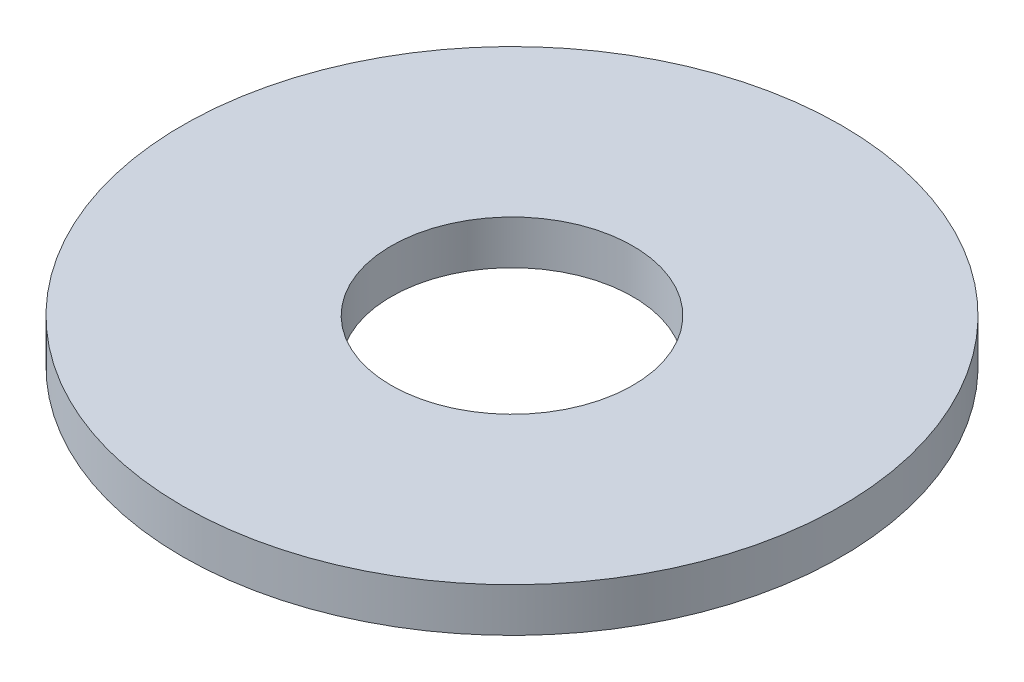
ISO-10303-21;
HEADER;
FILE_DESCRIPTION(('STEP AP214'),'2;1');
FILE_NAME('part.step','',(''),(''),'','','');
FILE_SCHEMA(('AUTOMOTIVE_DESIGN { 1 0 10303 214 1 1 1 1 }'));
ENDSEC;
DATA;
#1=APPLICATION_CONTEXT('core data for automotive mechanical design processes');
#2=APPLICATION_PROTOCOL_DEFINITION('international standard','automotive_design',2000,#1);
#3=PRODUCT_CONTEXT('',#1,'mechanical');
#4=PRODUCT('Part','Part','',(#3));
#5=PRODUCT_RELATED_PRODUCT_CATEGORY('part','',(#4));
#6=PRODUCT_DEFINITION_FORMATION('','',#4);
#7=PRODUCT_DEFINITION_CONTEXT('part definition',#1,'design');
#8=PRODUCT_DEFINITION('design','',#6,#7);
#9=PRODUCT_DEFINITION_SHAPE('','',#8);
#10=(LENGTH_UNIT() NAMED_UNIT(*) SI_UNIT(.MILLI.,.METRE.));
#11=(NAMED_UNIT(*) PLANE_ANGLE_UNIT() SI_UNIT($,.RADIAN.));
#12=(NAMED_UNIT(*) SI_UNIT($,.STERADIAN.) SOLID_ANGLE_UNIT());
#13=UNCERTAINTY_MEASURE_WITH_UNIT(LENGTH_MEASURE(1.E-05),#10,'distance_accuracy_value','');
#14=(GEOMETRIC_REPRESENTATION_CONTEXT(3) GLOBAL_UNCERTAINTY_ASSIGNED_CONTEXT((#13)) GLOBAL_UNIT_ASSIGNED_CONTEXT((#10,
#11,#12)) REPRESENTATION_CONTEXT('',''));
#15=CARTESIAN_POINT('',(0.,0.,0.));
#16=DIRECTION('',(0.,0.,1.));
#17=DIRECTION('',(1.,0.,0.));
#18=AXIS2_PLACEMENT_3D('',#15,#16,#17);
#19=CARTESIAN_POINT('',(0.,2.,0.));
#20=DIRECTION('',(0.,1.,0.));
#21=DIRECTION('',(0.,0.,1.));
#22=AXIS2_PLACEMENT_3D('',#19,#20,#21);
#23=PLANE('',#22);
#24=CARTESIAN_POINT('',(0.,2.,0.));
#25=DIRECTION('',(0.,1.,0.));
#26=DIRECTION('',(0.,0.,1.));
#27=AXIS2_PLACEMENT_3D('',#24,#25,#26);
#28=CIRCLE('',#27,15.);
#29=CARTESIAN_POINT('',(0.,2.,15.));
#30=VERTEX_POINT('',#29);
#31=EDGE_CURVE('E10',#30,#30,#28,.T.);
#32=ORIENTED_EDGE('',*,*,#31,.T.);
#33=EDGE_LOOP('',(#32));
#34=FACE_BOUND('',#33,.T.);
#35=CARTESIAN_POINT('',(0.,2.,0.));
#36=DIRECTION('',(0.,1.,0.));
#37=DIRECTION('',(0.,0.,1.));
#38=AXIS2_PLACEMENT_3D('',#35,#36,#37);
#39=CIRCLE('',#38,5.5);
#40=CARTESIAN_POINT('',(0.,2.,5.5));
#41=VERTEX_POINT('',#40);
#42=EDGE_CURVE('E40',#41,#41,#39,.T.);
#43=ORIENTED_EDGE('',*,*,#42,.F.);
#44=EDGE_LOOP('',(#43));
#45=FACE_BOUND('',#44,.T.);
#46=ADVANCED_FACE('F29',(#34,#45),#23,.T.);
#47=CARTESIAN_POINT('',(0.,0.,0.));
#48=DIRECTION('',(0.,1.,0.));
#49=DIRECTION('',(0.,0.,1.));
#50=AXIS2_PLACEMENT_3D('',#47,#48,#49);
#51=PLANE('',#50);
#52=CARTESIAN_POINT('',(0.,0.,0.));
#53=DIRECTION('',(0.,1.,0.));
#54=DIRECTION('',(0.,0.,1.));
#55=AXIS2_PLACEMENT_3D('',#52,#53,#54);
#56=CIRCLE('',#55,15.);
#57=CARTESIAN_POINT('',(0.,0.,15.));
#58=VERTEX_POINT('',#57);
#59=EDGE_CURVE('E36',#58,#58,#56,.T.);
#60=ORIENTED_EDGE('',*,*,#59,.F.);
#61=EDGE_LOOP('',(#60));
#62=FACE_BOUND('',#61,.T.);
#63=CARTESIAN_POINT('',(0.,0.,0.));
#64=DIRECTION('',(0.,1.,0.));
#65=DIRECTION('',(0.,0.,1.));
#66=AXIS2_PLACEMENT_3D('',#63,#64,#65);
#67=CIRCLE('',#66,5.5);
#68=CARTESIAN_POINT('',(0.,0.,5.5));
#69=VERTEX_POINT('',#68);
#70=EDGE_CURVE('E44',#69,#69,#67,.T.);
#71=ORIENTED_EDGE('',*,*,#70,.T.);
#72=EDGE_LOOP('',(#71));
#73=FACE_BOUND('',#72,.T.);
#74=ADVANCED_FACE('F50',(#62,#73),#51,.F.);
#75=CARTESIAN_POINT('',(0.,2.,0.));
#76=DIRECTION('',(0.,-1.,0.));
#77=DIRECTION('',(0.,0.,-1.));
#78=AXIS2_PLACEMENT_3D('',#75,#76,#77);
#79=CYLINDRICAL_SURFACE('',#78,15.);
#80=ORIENTED_EDGE('',*,*,#31,.F.);
#81=EDGE_LOOP('',(#80));
#82=FACE_BOUND('',#81,.T.);
#83=ORIENTED_EDGE('',*,*,#59,.T.);
#84=EDGE_LOOP('',(#83));
#85=FACE_BOUND('',#84,.T.);
#86=ADVANCED_FACE('F31',(#82,#85),#79,.T.);
#87=CARTESIAN_POINT('',(0.,2.,0.));
#88=DIRECTION('',(0.,-1.,0.));
#89=DIRECTION('',(0.,0.,-1.));
#90=AXIS2_PLACEMENT_3D('',#87,#88,#89);
#91=CYLINDRICAL_SURFACE('',#90,5.5);
#92=ORIENTED_EDGE('',*,*,#42,.T.);
#93=EDGE_LOOP('',(#92));
#94=FACE_BOUND('',#93,.T.);
#95=ORIENTED_EDGE('',*,*,#70,.F.);
#96=EDGE_LOOP('',(#95));
#97=FACE_BOUND('',#96,.T.);
#98=ADVANCED_FACE('F52',(#94,#97),#91,.F.);
#99=CLOSED_SHELL('',(#46,#74,#86,#98));
#100=MANIFOLD_SOLID_BREP('B2',#99);
#101=ADVANCED_BREP_SHAPE_REPRESENTATION('',(#18,#100),#14);
#102=SHAPE_DEFINITION_REPRESENTATION(#9,#101);
ENDSEC;
END-ISO-10303-21;
